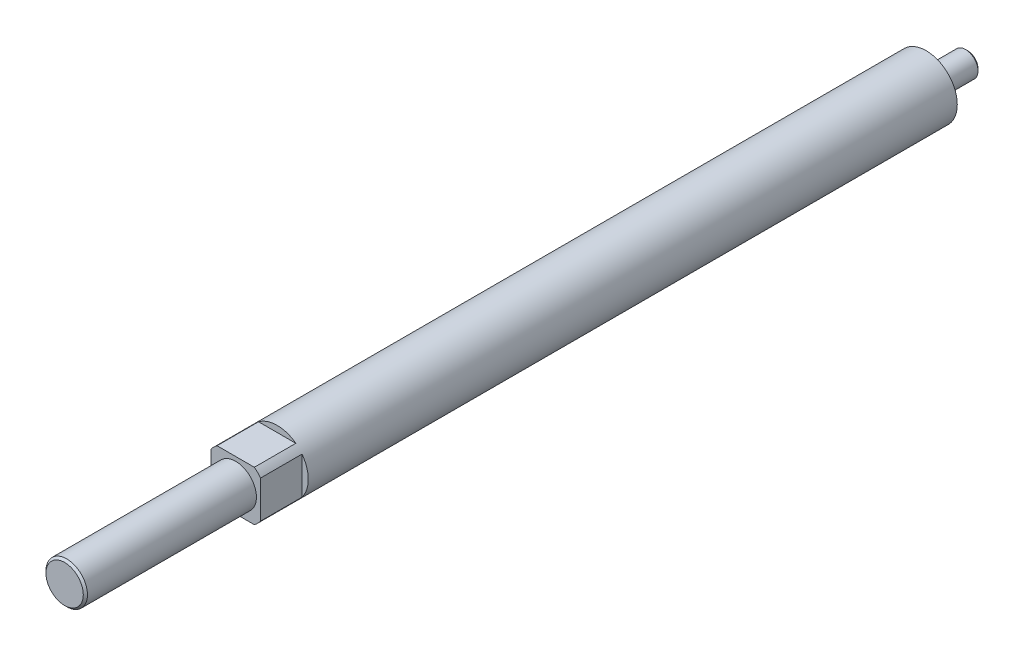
ISO-10303-21;
HEADER;
FILE_DESCRIPTION(('STEP AP214'),'2;1');
FILE_NAME('part.step','',(''),(''),'','','');
FILE_SCHEMA(('AUTOMOTIVE_DESIGN { 1 0 10303 214 1 1 1 1 }'));
ENDSEC;
DATA;
#1=APPLICATION_CONTEXT('core data for automotive mechanical design processes');
#2=APPLICATION_PROTOCOL_DEFINITION('international standard','automotive_design',2000,#1);
#3=PRODUCT_CONTEXT('',#1,'mechanical');
#4=PRODUCT('Part','Part','',(#3));
#5=PRODUCT_RELATED_PRODUCT_CATEGORY('part','',(#4));
#6=PRODUCT_DEFINITION_FORMATION('','',#4);
#7=PRODUCT_DEFINITION_CONTEXT('part definition',#1,'design');
#8=PRODUCT_DEFINITION('design','',#6,#7);
#9=PRODUCT_DEFINITION_SHAPE('','',#8);
#10=(LENGTH_UNIT() NAMED_UNIT(*) SI_UNIT(.MILLI.,.METRE.));
#11=(NAMED_UNIT(*) PLANE_ANGLE_UNIT() SI_UNIT($,.RADIAN.));
#12=(NAMED_UNIT(*) SI_UNIT($,.STERADIAN.) SOLID_ANGLE_UNIT());
#13=UNCERTAINTY_MEASURE_WITH_UNIT(LENGTH_MEASURE(1.E-05),#10,'distance_accuracy_value','');
#14=(GEOMETRIC_REPRESENTATION_CONTEXT(3) GLOBAL_UNCERTAINTY_ASSIGNED_CONTEXT((#13)) GLOBAL_UNIT_ASSIGNED_CONTEXT((#10,
#11,#12)) REPRESENTATION_CONTEXT('',''));
#15=CARTESIAN_POINT('',(0.,0.,0.));
#16=DIRECTION('',(0.,0.,1.));
#17=DIRECTION('',(1.,0.,0.));
#18=AXIS2_PLACEMENT_3D('',#15,#16,#17);
#19=CARTESIAN_POINT('',(0.,0.,353.));
#20=DIRECTION('',(0.,0.,1.));
#21=DIRECTION('',(1.,0.,0.));
#22=AXIS2_PLACEMENT_3D('',#19,#20,#21);
#23=PLANE('',#22);
#24=DIRECTION('',(0.,-1.,0.));
#25=VECTOR('',#24,1.);
#26=CARTESIAN_POINT('',(12.,12.,353.));
#27=LINE('',#26,#25);
#28=CARTESIAN_POINT('',(12.,9.00000000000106,353.));
#29=VERTEX_POINT('',#28);
#30=CARTESIAN_POINT('',(12.,-9.00000000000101,353.));
#31=VERTEX_POINT('',#30);
#32=EDGE_CURVE('E31',#29,#31,#27,.T.);
#33=ORIENTED_EDGE('',*,*,#32,.F.);
#34=CARTESIAN_POINT('',(0.,0.,353.));
#35=DIRECTION('',(0.,0.,1.));
#36=DIRECTION('',(1.,0.,0.));
#37=AXIS2_PLACEMENT_3D('',#34,#35,#36);
#38=CIRCLE('',#37,15.0000000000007);
#39=CARTESIAN_POINT('',(9.00000000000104,12.,353.));
#40=VERTEX_POINT('',#39);
#41=EDGE_CURVE('E101',#29,#40,#38,.T.);
#42=ORIENTED_EDGE('',*,*,#41,.T.);
#43=DIRECTION('',(1.,0.,0.));
#44=VECTOR('',#43,1.);
#45=CARTESIAN_POINT('',(12.,12.,353.));
#46=LINE('',#45,#44);
#47=CARTESIAN_POINT('',(-9.00000000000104,12.,353.));
#48=VERTEX_POINT('',#47);
#49=EDGE_CURVE('E84',#48,#40,#46,.T.);
#50=ORIENTED_EDGE('',*,*,#49,.F.);
#51=CARTESIAN_POINT('',(-12.,9.00000000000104,353.));
#52=VERTEX_POINT('',#51);
#53=EDGE_CURVE('E99',#48,#52,#38,.T.);
#54=ORIENTED_EDGE('',*,*,#53,.T.);
#55=DIRECTION('',(0.,1.,0.));
#56=VECTOR('',#55,1.);
#57=CARTESIAN_POINT('',(-12.,12.,353.));
#58=LINE('',#57,#56);
#59=CARTESIAN_POINT('',(-12.,-9.00000000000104,353.));
#60=VERTEX_POINT('',#59);
#61=EDGE_CURVE('E103',#60,#52,#58,.T.);
#62=ORIENTED_EDGE('',*,*,#61,.F.);
#63=CARTESIAN_POINT('',(-9.00000000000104,-12.,353.));
#64=VERTEX_POINT('',#63);
#65=EDGE_CURVE('E109',#60,#64,#38,.T.);
#66=ORIENTED_EDGE('',*,*,#65,.T.);
#67=DIRECTION('',(-1.,0.,0.));
#68=VECTOR('',#67,1.);
#69=CARTESIAN_POINT('',(12.,-12.,353.));
#70=LINE('',#69,#68);
#71=CARTESIAN_POINT('',(9.00000000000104,-12.,353.));
#72=VERTEX_POINT('',#71);
#73=EDGE_CURVE('E39',#72,#64,#70,.T.);
#74=ORIENTED_EDGE('',*,*,#73,.F.);
#75=EDGE_CURVE('E112',#72,#31,#38,.T.);
#76=ORIENTED_EDGE('',*,*,#75,.T.);
#77=EDGE_LOOP('',(#33,#42,#50,#54,#62,#66,#74,#76));
#78=FACE_BOUND('',#77,.T.);
#79=CARTESIAN_POINT('',(0.,0.,353.));
#80=DIRECTION('',(0.,0.,1.));
#81=DIRECTION('',(1.,0.,0.));
#82=AXIS2_PLACEMENT_3D('',#79,#80,#81);
#83=CIRCLE('',#82,10.);
#84=CARTESIAN_POINT('',(10.,0.,353.));
#85=VERTEX_POINT('',#84);
#86=EDGE_CURVE('E116',#85,#85,#83,.T.);
#87=ORIENTED_EDGE('',*,*,#86,.F.);
#88=EDGE_LOOP('',(#87));
#89=FACE_BOUND('',#88,.T.);
#90=ADVANCED_FACE('F16',(#78,#89),#23,.T.);
#91=CARTESIAN_POINT('',(0.,0.,20.));
#92=DIRECTION('',(0.,0.,1.));
#93=DIRECTION('',(1.,0.,0.));
#94=AXIS2_PLACEMENT_3D('',#91,#92,#93);
#95=PLANE('',#94);
#96=CARTESIAN_POINT('',(0.,0.,20.));
#97=DIRECTION('',(0.,0.,1.));
#98=DIRECTION('',(1.,0.,0.));
#99=AXIS2_PLACEMENT_3D('',#96,#97,#98);
#100=CIRCLE('',#99,15.0000000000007);
#101=CARTESIAN_POINT('',(15.0000000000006,0.,20.));
#102=VERTEX_POINT('',#101);
#103=EDGE_CURVE('E118',#102,#102,#100,.T.);
#104=ORIENTED_EDGE('',*,*,#103,.F.);
#105=EDGE_LOOP('',(#104));
#106=FACE_BOUND('',#105,.T.);
#107=CARTESIAN_POINT('',(0.,0.,20.));
#108=DIRECTION('',(0.,0.,-1.));
#109=DIRECTION('',(-1.,0.,0.));
#110=AXIS2_PLACEMENT_3D('',#107,#108,#109);
#111=CIRCLE('',#110,5.);
#112=CARTESIAN_POINT('',(-5.00000000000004,0.,20.));
#113=VERTEX_POINT('',#112);
#114=EDGE_CURVE('E173',#113,#113,#111,.T.);
#115=ORIENTED_EDGE('',*,*,#114,.F.);
#116=EDGE_LOOP('',(#115));
#117=FACE_BOUND('',#116,.T.);
#118=ADVANCED_FACE('F182',(#106,#117),#95,.F.);
#119=CARTESIAN_POINT('',(0.,0.,353.));
#120=DIRECTION('',(0.,0.,-1.));
#121=DIRECTION('',(-1.,0.,0.));
#122=AXIS2_PLACEMENT_3D('',#119,#120,#121);
#123=CYLINDRICAL_SURFACE('',#122,15.0000000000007);
#124=ORIENTED_EDGE('',*,*,#41,.F.);
#125=DIRECTION('',(0.,0.,-1.));
#126=VECTOR('',#125,1.);
#127=CARTESIAN_POINT('',(12.,9.00000000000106,353.));
#128=LINE('',#127,#126);
#129=CARTESIAN_POINT('',(12.,9.00000000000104,333.));
#130=VERTEX_POINT('',#129);
#131=EDGE_CURVE('E11',#29,#130,#128,.T.);
#132=ORIENTED_EDGE('',*,*,#131,.T.);
#133=CARTESIAN_POINT('',(0.,0.,333.));
#134=DIRECTION('',(0.,0.,-1.));
#135=DIRECTION('',(-1.,0.,0.));
#136=AXIS2_PLACEMENT_3D('',#133,#134,#135);
#137=CIRCLE('',#136,15.0000000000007);
#138=CARTESIAN_POINT('',(12.,-9.00000000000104,333.));
#139=VERTEX_POINT('',#138);
#140=EDGE_CURVE('E24',#130,#139,#137,.T.);
#141=ORIENTED_EDGE('',*,*,#140,.T.);
#142=DIRECTION('',(0.,0.,-1.));
#143=VECTOR('',#142,1.);
#144=CARTESIAN_POINT('',(12.,-9.00000000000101,353.));
#145=LINE('',#144,#143);
#146=EDGE_CURVE('E145',#139,#31,#145,.F.);
#147=ORIENTED_EDGE('',*,*,#146,.T.);
#148=ORIENTED_EDGE('',*,*,#75,.F.);
#149=DIRECTION('',(0.,0.,-1.));
#150=VECTOR('',#149,1.);
#151=CARTESIAN_POINT('',(9.00000000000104,-12.,353.));
#152=LINE('',#151,#150);
#153=CARTESIAN_POINT('',(9.00000000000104,-12.,333.));
#154=VERTEX_POINT('',#153);
#155=EDGE_CURVE('E143',#72,#154,#152,.T.);
#156=ORIENTED_EDGE('',*,*,#155,.T.);
#157=CARTESIAN_POINT('',(-9.00000000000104,-12.,333.));
#158=VERTEX_POINT('',#157);
#159=EDGE_CURVE('E142',#154,#158,#137,.T.);
#160=ORIENTED_EDGE('',*,*,#159,.T.);
#161=DIRECTION('',(0.,0.,-1.));
#162=VECTOR('',#161,1.);
#163=CARTESIAN_POINT('',(-9.00000000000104,-12.,353.));
#164=LINE('',#163,#162);
#165=EDGE_CURVE('E140',#158,#64,#164,.F.);
#166=ORIENTED_EDGE('',*,*,#165,.T.);
#167=ORIENTED_EDGE('',*,*,#65,.F.);
#168=DIRECTION('',(0.,0.,-1.));
#169=VECTOR('',#168,1.);
#170=CARTESIAN_POINT('',(-12.,-9.00000000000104,353.));
#171=LINE('',#170,#169);
#172=CARTESIAN_POINT('',(-12.,-9.00000000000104,333.));
#173=VERTEX_POINT('',#172);
#174=EDGE_CURVE('E137',#60,#173,#171,.T.);
#175=ORIENTED_EDGE('',*,*,#174,.T.);
#176=CARTESIAN_POINT('',(-12.,9.00000000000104,333.));
#177=VERTEX_POINT('',#176);
#178=EDGE_CURVE('E134',#173,#177,#137,.T.);
#179=ORIENTED_EDGE('',*,*,#178,.T.);
#180=DIRECTION('',(0.,0.,-1.));
#181=VECTOR('',#180,1.);
#182=CARTESIAN_POINT('',(-12.,9.00000000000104,353.));
#183=LINE('',#182,#181);
#184=EDGE_CURVE('E91',#177,#52,#183,.F.);
#185=ORIENTED_EDGE('',*,*,#184,.T.);
#186=ORIENTED_EDGE('',*,*,#53,.F.);
#187=DIRECTION('',(0.,0.,-1.));
#188=VECTOR('',#187,1.);
#189=CARTESIAN_POINT('',(-9.00000000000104,12.,353.));
#190=LINE('',#189,#188);
#191=CARTESIAN_POINT('',(-9.00000000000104,12.,333.));
#192=VERTEX_POINT('',#191);
#193=EDGE_CURVE('E81',#48,#192,#190,.T.);
#194=ORIENTED_EDGE('',*,*,#193,.T.);
#195=CARTESIAN_POINT('',(9.00000000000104,12.,333.));
#196=VERTEX_POINT('',#195);
#197=EDGE_CURVE('E92',#192,#196,#137,.T.);
#198=ORIENTED_EDGE('',*,*,#197,.T.);
#199=DIRECTION('',(0.,0.,-1.));
#200=VECTOR('',#199,1.);
#201=CARTESIAN_POINT('',(9.00000000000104,12.,353.));
#202=LINE('',#201,#200);
#203=EDGE_CURVE('E132',#196,#40,#202,.F.);
#204=ORIENTED_EDGE('',*,*,#203,.T.);
#205=EDGE_LOOP('',(#124,#132,#141,#147,#148,#156,#160,#166,#167,#175,#179,#185,#186,#194,#198,#204));
#206=FACE_BOUND('',#205,.T.);
#207=ORIENTED_EDGE('',*,*,#103,.T.);
#208=EDGE_LOOP('',(#207));
#209=FACE_BOUND('',#208,.T.);
#210=ADVANCED_FACE('F106',(#206,#209),#123,.T.);
#211=CARTESIAN_POINT('',(0.,0.,435.5));
#212=DIRECTION('',(0.,0.,-1.));
#213=DIRECTION('',(-1.,0.,0.));
#214=AXIS2_PLACEMENT_3D('',#211,#212,#213);
#215=CYLINDRICAL_SURFACE('',#214,10.);
#216=CARTESIAN_POINT('',(0.,0.,434.5));
#217=DIRECTION('',(0.,0.,1.));
#218=DIRECTION('',(1.,0.,0.));
#219=AXIS2_PLACEMENT_3D('',#216,#217,#218);
#220=CIRCLE('',#219,10.);
#221=CARTESIAN_POINT('',(10.,0.,434.5));
#222=VERTEX_POINT('',#221);
#223=EDGE_CURVE('E129',#222,#222,#220,.F.);
#224=ORIENTED_EDGE('',*,*,#223,.T.);
#225=EDGE_LOOP('',(#224));
#226=FACE_BOUND('',#225,.T.);
#227=ORIENTED_EDGE('',*,*,#86,.T.);
#228=EDGE_LOOP('',(#227));
#229=FACE_BOUND('',#228,.T.);
#230=ADVANCED_FACE('F180',(#226,#229),#215,.T.);
#231=CARTESIAN_POINT('',(0.,0.,435.5));
#232=DIRECTION('',(0.,0.,1.));
#233=DIRECTION('',(1.,0.,0.));
#234=AXIS2_PLACEMENT_3D('',#231,#232,#233);
#235=PLANE('',#234);
#236=CARTESIAN_POINT('',(0.,0.,435.5));
#237=DIRECTION('',(0.,0.,1.));
#238=DIRECTION('',(1.,0.,0.));
#239=AXIS2_PLACEMENT_3D('',#236,#237,#238);
#240=CIRCLE('',#239,9.);
#241=CARTESIAN_POINT('',(9.,0.,435.5));
#242=VERTEX_POINT('',#241);
#243=EDGE_CURVE('E126',#242,#242,#240,.T.);
#244=ORIENTED_EDGE('',*,*,#243,.T.);
#245=EDGE_LOOP('',(#244));
#246=FACE_BOUND('',#245,.T.);
#247=ADVANCED_FACE('F297',(#246),#235,.T.);
#248=CARTESIAN_POINT('',(0.,0.,435.5));
#249=DIRECTION('',(0.,0.,-1.));
#250=DIRECTION('',(-1.,0.,0.));
#251=AXIS2_PLACEMENT_3D('',#248,#249,#250);
#252=CONICAL_SURFACE('',#251,9.,0.785398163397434);
#253=ORIENTED_EDGE('',*,*,#223,.F.);
#254=EDGE_LOOP('',(#253));
#255=FACE_BOUND('',#254,.T.);
#256=ORIENTED_EDGE('',*,*,#243,.F.);
#257=EDGE_LOOP('',(#256));
#258=FACE_BOUND('',#257,.T.);
#259=ADVANCED_FACE('F18',(#255,#258),#252,.T.);
#260=CARTESIAN_POINT('',(0.,0.,0.));
#261=DIRECTION('',(0.,0.,-1.));
#262=DIRECTION('',(-1.,0.,0.));
#263=AXIS2_PLACEMENT_3D('',#260,#261,#262);
#264=CYLINDRICAL_SURFACE('',#263,5.);
#265=CARTESIAN_POINT('',(0.,0.,17.));
#266=DIRECTION('',(0.,0.,-1.));
#267=DIRECTION('',(-1.,0.,0.));
#268=AXIS2_PLACEMENT_3D('',#265,#266,#267);
#269=CIRCLE('',#268,5.);
#270=CARTESIAN_POINT('',(-5.00000000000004,0.,17.));
#271=VERTEX_POINT('',#270);
#272=EDGE_CURVE('E171',#271,#271,#269,.T.);
#273=ORIENTED_EDGE('',*,*,#272,.F.);
#274=EDGE_LOOP('',(#273));
#275=FACE_BOUND('',#274,.T.);
#276=ORIENTED_EDGE('',*,*,#114,.T.);
#277=EDGE_LOOP('',(#276));
#278=FACE_BOUND('',#277,.T.);
#279=ADVANCED_FACE('F284',(#275,#278),#264,.T.);
#280=CARTESIAN_POINT('',(-6.,0.,17.));
#281=DIRECTION('',(0.,0.,-1.));
#282=DIRECTION('',(-1.,0.,0.));
#283=AXIS2_PLACEMENT_3D('',#280,#281,#282);
#284=PLANE('',#283);
#285=CARTESIAN_POINT('',(0.,0.,17.));
#286=DIRECTION('',(0.,0.,-1.));
#287=DIRECTION('',(-1.,0.,0.));
#288=AXIS2_PLACEMENT_3D('',#285,#286,#287);
#289=CIRCLE('',#288,6.);
#290=CARTESIAN_POINT('',(-6.00000000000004,0.,17.));
#291=VERTEX_POINT('',#290);
#292=EDGE_CURVE('E160',#291,#291,#289,.T.);
#293=ORIENTED_EDGE('',*,*,#292,.F.);
#294=EDGE_LOOP('',(#293));
#295=FACE_BOUND('',#294,.T.);
#296=ORIENTED_EDGE('',*,*,#272,.T.);
#297=EDGE_LOOP('',(#296));
#298=FACE_BOUND('',#297,.T.);
#299=ADVANCED_FACE('F200',(#295,#298),#284,.F.);
#300=CARTESIAN_POINT('',(0.,0.,0.));
#301=DIRECTION('',(0.,0.,1.));
#302=DIRECTION('',(1.,0.,0.));
#303=AXIS2_PLACEMENT_3D('',#300,#301,#302);
#304=PLANE('',#303);
#305=CARTESIAN_POINT('',(0.,0.,0.));
#306=DIRECTION('',(0.,0.,1.));
#307=DIRECTION('',(1.,0.,0.));
#308=AXIS2_PLACEMENT_3D('',#305,#306,#307);
#309=CIRCLE('',#308,5.);
#310=CARTESIAN_POINT('',(5.,0.,0.));
#311=VERTEX_POINT('',#310);
#312=EDGE_CURVE('E123',#311,#311,#309,.F.);
#313=ORIENTED_EDGE('',*,*,#312,.T.);
#314=EDGE_LOOP('',(#313));
#315=FACE_BOUND('',#314,.T.);
#316=ADVANCED_FACE('F196',(#315),#304,.F.);
#317=CARTESIAN_POINT('',(0.,0.,1.));
#318=DIRECTION('',(0.,0.,1.));
#319=DIRECTION('',(1.,0.,0.));
#320=AXIS2_PLACEMENT_3D('',#317,#318,#319);
#321=CONICAL_SURFACE('',#320,6.,0.78539816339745);
#322=ORIENTED_EDGE('',*,*,#312,.F.);
#323=EDGE_LOOP('',(#322));
#324=FACE_BOUND('',#323,.T.);
#325=CARTESIAN_POINT('',(0.,0.,1.));
#326=DIRECTION('',(0.,0.,1.));
#327=DIRECTION('',(1.,0.,0.));
#328=AXIS2_PLACEMENT_3D('',#325,#326,#327);
#329=CIRCLE('',#328,6.);
#330=CARTESIAN_POINT('',(6.,0.,1.));
#331=VERTEX_POINT('',#330);
#332=EDGE_CURVE('E111',#331,#331,#329,.T.);
#333=ORIENTED_EDGE('',*,*,#332,.F.);
#334=EDGE_LOOP('',(#333));
#335=FACE_BOUND('',#334,.T.);
#336=ADVANCED_FACE('F199',(#324,#335),#321,.T.);
#337=CARTESIAN_POINT('',(0.,0.,20.));
#338=DIRECTION('',(0.,0.,-1.));
#339=DIRECTION('',(-1.,0.,0.));
#340=AXIS2_PLACEMENT_3D('',#337,#338,#339);
#341=CYLINDRICAL_SURFACE('',#340,6.);
#342=ORIENTED_EDGE('',*,*,#292,.T.);
#343=EDGE_LOOP('',(#342));
#344=FACE_BOUND('',#343,.T.);
#345=ORIENTED_EDGE('',*,*,#332,.T.);
#346=EDGE_LOOP('',(#345));
#347=FACE_BOUND('',#346,.T.);
#348=ADVANCED_FACE('F202',(#344,#347),#341,.T.);
#349=CARTESIAN_POINT('',(12.,12.,333.));
#350=DIRECTION('',(0.,-1.,0.));
#351=DIRECTION('',(0.,0.,-1.));
#352=AXIS2_PLACEMENT_3D('',#349,#350,#351);
#353=PLANE('',#352);
#354=ORIENTED_EDGE('',*,*,#49,.T.);
#355=ORIENTED_EDGE('',*,*,#203,.F.);
#356=DIRECTION('',(1.,0.,0.));
#357=VECTOR('',#356,1.);
#358=CARTESIAN_POINT('',(12.,12.,333.));
#359=LINE('',#358,#357);
#360=EDGE_CURVE('E87',#192,#196,#359,.T.);
#361=ORIENTED_EDGE('',*,*,#360,.F.);
#362=ORIENTED_EDGE('',*,*,#193,.F.);
#363=EDGE_LOOP('',(#354,#355,#361,#362));
#364=FACE_BOUND('',#363,.T.);
#365=ADVANCED_FACE('F83',(#364),#353,.F.);
#366=CARTESIAN_POINT('',(0.,0.,333.));
#367=DIRECTION('',(0.,0.,-1.));
#368=DIRECTION('',(-1.,0.,0.));
#369=AXIS2_PLACEMENT_3D('',#366,#367,#368);
#370=PLANE('',#369);
#371=ORIENTED_EDGE('',*,*,#360,.T.);
#372=ORIENTED_EDGE('',*,*,#197,.F.);
#373=EDGE_LOOP('',(#371,#372));
#374=FACE_BOUND('',#373,.T.);
#375=ADVANCED_FACE('F231',(#374),#370,.F.);
#376=CARTESIAN_POINT('',(-12.,12.,333.));
#377=DIRECTION('',(1.,0.,0.));
#378=DIRECTION('',(0.,0.,-1.));
#379=AXIS2_PLACEMENT_3D('',#376,#377,#378);
#380=PLANE('',#379);
#381=ORIENTED_EDGE('',*,*,#61,.T.);
#382=ORIENTED_EDGE('',*,*,#184,.F.);
#383=DIRECTION('',(0.,1.,0.));
#384=VECTOR('',#383,1.);
#385=CARTESIAN_POINT('',(-12.,12.,333.));
#386=LINE('',#385,#384);
#387=EDGE_CURVE('E155',#173,#177,#386,.T.);
#388=ORIENTED_EDGE('',*,*,#387,.F.);
#389=ORIENTED_EDGE('',*,*,#174,.F.);
#390=EDGE_LOOP('',(#381,#382,#388,#389));
#391=FACE_BOUND('',#390,.T.);
#392=ADVANCED_FACE('F157',(#391),#380,.F.);
#393=ORIENTED_EDGE('',*,*,#387,.T.);
#394=ORIENTED_EDGE('',*,*,#178,.F.);
#395=EDGE_LOOP('',(#393,#394));
#396=FACE_BOUND('',#395,.T.);
#397=ADVANCED_FACE('F154',(#396),#370,.F.);
#398=CARTESIAN_POINT('',(12.,-12.,333.));
#399=DIRECTION('',(0.,1.,0.));
#400=DIRECTION('',(0.,0.,1.));
#401=AXIS2_PLACEMENT_3D('',#398,#399,#400);
#402=PLANE('',#401);
#403=ORIENTED_EDGE('',*,*,#73,.T.);
#404=ORIENTED_EDGE('',*,*,#165,.F.);
#405=DIRECTION('',(-1.,0.,0.));
#406=VECTOR('',#405,1.);
#407=CARTESIAN_POINT('',(12.,-12.,333.));
#408=LINE('',#407,#406);
#409=EDGE_CURVE('E158',#154,#158,#408,.T.);
#410=ORIENTED_EDGE('',*,*,#409,.F.);
#411=ORIENTED_EDGE('',*,*,#155,.F.);
#412=EDGE_LOOP('',(#403,#404,#410,#411));
#413=FACE_BOUND('',#412,.T.);
#414=ADVANCED_FACE('F252',(#413),#402,.F.);
#415=ORIENTED_EDGE('',*,*,#409,.T.);
#416=ORIENTED_EDGE('',*,*,#159,.F.);
#417=EDGE_LOOP('',(#415,#416));
#418=FACE_BOUND('',#417,.T.);
#419=ADVANCED_FACE('F253',(#418),#370,.F.);
#420=DIRECTION('',(0.,-1.,0.));
#421=VECTOR('',#420,1.);
#422=CARTESIAN_POINT('',(12.,12.,333.));
#423=LINE('',#422,#421);
#424=EDGE_CURVE('E102',#130,#139,#423,.T.);
#425=ORIENTED_EDGE('',*,*,#424,.T.);
#426=ORIENTED_EDGE('',*,*,#140,.F.);
#427=EDGE_LOOP('',(#425,#426));
#428=FACE_BOUND('',#427,.T.);
#429=ADVANCED_FACE('F240',(#428),#370,.F.);
#430=CARTESIAN_POINT('',(12.,12.,333.));
#431=DIRECTION('',(-1.,0.,0.));
#432=DIRECTION('',(0.,0.,1.));
#433=AXIS2_PLACEMENT_3D('',#430,#431,#432);
#434=PLANE('',#433);
#435=ORIENTED_EDGE('',*,*,#32,.T.);
#436=ORIENTED_EDGE('',*,*,#146,.F.);
#437=ORIENTED_EDGE('',*,*,#424,.F.);
#438=ORIENTED_EDGE('',*,*,#131,.F.);
#439=EDGE_LOOP('',(#435,#436,#437,#438));
#440=FACE_BOUND('',#439,.T.);
#441=ADVANCED_FACE('F271',(#440),#434,.F.);
#442=CLOSED_SHELL('',(#90,#118,#210,#230,#247,#259,#279,#299,#316,#336,#348,#365,#375,#392,#397,
#414,#419,#429,#441));
#443=MANIFOLD_SOLID_BREP('B1',#442);
#444=ADVANCED_BREP_SHAPE_REPRESENTATION('',(#18,#443),#14);
#445=SHAPE_DEFINITION_REPRESENTATION(#9,#444);
ENDSEC;
END-ISO-10303-21;
